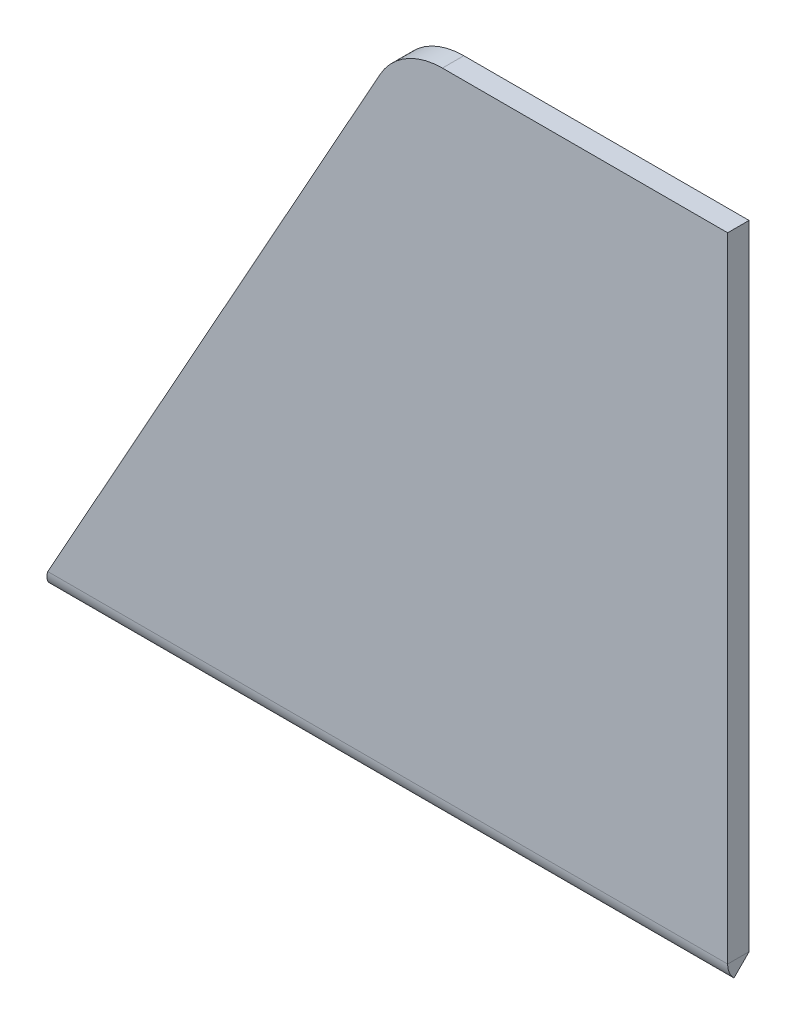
ISO-10303-21;
HEADER;
FILE_DESCRIPTION(('STEP AP214'),'2;1');
FILE_NAME('part.step','',(''),(''),'','','');
FILE_SCHEMA(('AUTOMOTIVE_DESIGN { 1 0 10303 214 1 1 1 1 }'));
ENDSEC;
DATA;
#1=APPLICATION_CONTEXT('core data for automotive mechanical design processes');
#2=APPLICATION_PROTOCOL_DEFINITION('international standard','automotive_design',2000,#1);
#3=PRODUCT_CONTEXT('',#1,'mechanical');
#4=PRODUCT('Part','Part','',(#3));
#5=PRODUCT_RELATED_PRODUCT_CATEGORY('part','',(#4));
#6=PRODUCT_DEFINITION_FORMATION('','',#4);
#7=PRODUCT_DEFINITION_CONTEXT('part definition',#1,'design');
#8=PRODUCT_DEFINITION('design','',#6,#7);
#9=PRODUCT_DEFINITION_SHAPE('','',#8);
#10=(LENGTH_UNIT() NAMED_UNIT(*) SI_UNIT(.MILLI.,.METRE.));
#11=(NAMED_UNIT(*) PLANE_ANGLE_UNIT() SI_UNIT($,.RADIAN.));
#12=(NAMED_UNIT(*) SI_UNIT($,.STERADIAN.) SOLID_ANGLE_UNIT());
#13=UNCERTAINTY_MEASURE_WITH_UNIT(LENGTH_MEASURE(1.E-05),#10,'distance_accuracy_value','');
#14=(GEOMETRIC_REPRESENTATION_CONTEXT(3) GLOBAL_UNCERTAINTY_ASSIGNED_CONTEXT((#13)) GLOBAL_UNIT_ASSIGNED_CONTEXT((#10,
#11,#12)) REPRESENTATION_CONTEXT('',''));
#15=CARTESIAN_POINT('',(0.,0.,0.));
#16=DIRECTION('',(0.,0.,1.));
#17=DIRECTION('',(1.,0.,0.));
#18=AXIS2_PLACEMENT_3D('',#15,#16,#17);
#19=CARTESIAN_POINT('',(30.,-0.9130973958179,-9.41309739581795));
#20=DIRECTION('',(-1.,0.,0.));
#21=DIRECTION('',(0.,-1.,0.));
#22=AXIS2_PLACEMENT_3D('',#19,#20,#21);
#23=PLANE('',#22);
#24=DIRECTION('',(0.,0.,1.));
#25=VECTOR('',#24,1.);
#26=CARTESIAN_POINT('',(30.,0.5869026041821,-9.41309739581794));
#27=LINE('',#26,#25);
#28=CARTESIAN_POINT('',(30.,0.5869026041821,-9.41309739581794));
#29=VERTEX_POINT('',#28);
#30=CARTESIAN_POINT('',(30.,0.586902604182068,-0.0100000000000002));
#31=VERTEX_POINT('',#30);
#32=EDGE_CURVE('E68',#29,#31,#27,.T.);
#33=ORIENTED_EDGE('',*,*,#32,.T.);
#34=DIRECTION('',(0.,-1.,0.));
#35=VECTOR('',#34,1.);
#36=CARTESIAN_POINT('',(30.,-0.913097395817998,-0.0100000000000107));
#37=LINE('',#36,#35);
#38=CARTESIAN_POINT('',(30.,-0.913097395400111,-0.0100000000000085));
#39=VERTEX_POINT('',#38);
#40=EDGE_CURVE('E160',#31,#39,#37,.T.);
#41=ORIENTED_EDGE('',*,*,#40,.T.);
#42=DIRECTION('',(0.,0.,1.));
#43=VECTOR('',#42,1.);
#44=CARTESIAN_POINT('',(30.,-0.9130973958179,-9.41309739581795));
#45=LINE('',#44,#43);
#46=CARTESIAN_POINT('',(30.,-0.9130973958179,-9.41309739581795));
#47=VERTEX_POINT('',#46);
#48=EDGE_CURVE('E340',#47,#39,#45,.T.);
#49=ORIENTED_EDGE('',*,*,#48,.F.);
#50=DIRECTION('',(0.,1.,0.));
#51=VECTOR('',#50,1.);
#52=CARTESIAN_POINT('',(30.,-0.9130973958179,-9.41309739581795));
#53=LINE('',#52,#51);
#54=EDGE_CURVE('E341',#47,#29,#53,.T.);
#55=ORIENTED_EDGE('',*,*,#54,.T.);
#56=EDGE_LOOP('',(#33,#41,#49,#55));
#57=FACE_BOUND('',#56,.T.);
#58=ADVANCED_FACE('F44',(#57),#23,.F.);
#59=CARTESIAN_POINT('',(0.,-0.913097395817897,-9.41309739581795));
#60=DIRECTION('',(1.,0.,0.));
#61=DIRECTION('',(0.,1.,0.));
#62=AXIS2_PLACEMENT_3D('',#59,#60,#61);
#63=PLANE('',#62);
#64=DIRECTION('',(0.,0.,-1.));
#65=VECTOR('',#64,1.);
#66=CARTESIAN_POINT('',(0.,-0.913097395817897,-9.41309739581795));
#67=LINE('',#66,#65);
#68=CARTESIAN_POINT('',(0.,-0.913097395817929,-0.0100000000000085));
#69=VERTEX_POINT('',#68);
#70=CARTESIAN_POINT('',(0.,-0.913097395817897,-9.41309739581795));
#71=VERTEX_POINT('',#70);
#72=EDGE_CURVE('E48',#69,#71,#67,.T.);
#73=ORIENTED_EDGE('',*,*,#72,.F.);
#74=DIRECTION('',(0.,1.,0.));
#75=VECTOR('',#74,1.);
#76=CARTESIAN_POINT('',(0.,-0.913097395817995,-0.0100000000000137));
#77=LINE('',#76,#75);
#78=CARTESIAN_POINT('',(0.,0.58690260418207,-0.0100000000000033));
#79=VERTEX_POINT('',#78);
#80=EDGE_CURVE('E12',#69,#79,#77,.T.);
#81=ORIENTED_EDGE('',*,*,#80,.T.);
#82=DIRECTION('',(0.,0.,-1.));
#83=VECTOR('',#82,1.);
#84=CARTESIAN_POINT('',(0.,0.586902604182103,-9.41309739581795));
#85=LINE('',#84,#83);
#86=CARTESIAN_POINT('',(0.,0.586902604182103,-9.41309739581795));
#87=VERTEX_POINT('',#86);
#88=EDGE_CURVE('E61',#79,#87,#85,.T.);
#89=ORIENTED_EDGE('',*,*,#88,.T.);
#90=DIRECTION('',(0.,1.,0.));
#91=VECTOR('',#90,1.);
#92=CARTESIAN_POINT('',(0.,-0.913097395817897,-9.41309739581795));
#93=LINE('',#92,#91);
#94=EDGE_CURVE('E343',#71,#87,#93,.T.);
#95=ORIENTED_EDGE('',*,*,#94,.F.);
#96=EDGE_LOOP('',(#73,#81,#89,#95));
#97=FACE_BOUND('',#96,.T.);
#98=ADVANCED_FACE('F46',(#97),#63,.F.);
#99=CARTESIAN_POINT('',(28.0000000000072,0.586902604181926,40.5869026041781));
#100=DIRECTION('',(0.,-1.,0.));
#101=DIRECTION('',(1.,0.,0.));
#102=AXIS2_PLACEMENT_3D('',#99,#100,#101);
#103=PLANE('',#102);
#104=CARTESIAN_POINT('',(22.,0.586902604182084,-4.41309739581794));
#105=DIRECTION('',(0.,-1.,0.));
#106=DIRECTION('',(1.,0.,0.));
#107=AXIS2_PLACEMENT_3D('',#104,#105,#106);
#108=CIRCLE('',#107,1.75);
#109=CARTESIAN_POINT('',(23.75,0.586902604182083,-4.41309739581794));
#110=VERTEX_POINT('',#109);
#111=EDGE_CURVE('E268',#110,#110,#108,.T.);
#112=ORIENTED_EDGE('',*,*,#111,.T.);
#113=EDGE_LOOP('',(#112));
#114=FACE_BOUND('',#113,.T.);
#115=CARTESIAN_POINT('',(8.,0.586902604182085,-4.41309739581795));
#116=DIRECTION('',(0.,-1.,0.));
#117=DIRECTION('',(1.,0.,0.));
#118=AXIS2_PLACEMENT_3D('',#115,#116,#117);
#119=CIRCLE('',#118,1.75);
#120=CARTESIAN_POINT('',(9.75,0.586902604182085,-4.41309739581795));
#121=VERTEX_POINT('',#120);
#122=EDGE_CURVE('E325',#121,#121,#119,.T.);
#123=ORIENTED_EDGE('',*,*,#122,.T.);
#124=EDGE_LOOP('',(#123));
#125=FACE_BOUND('',#124,.T.);
#126=ORIENTED_EDGE('',*,*,#88,.F.);
#127=DIRECTION('',(1.,0.,0.));
#128=VECTOR('',#127,1.);
#129=CARTESIAN_POINT('',(28.0000000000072,0.586902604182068,-0.00999999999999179));
#130=LINE('',#129,#128);
#131=EDGE_CURVE('E53',#79,#31,#130,.T.);
#132=ORIENTED_EDGE('',*,*,#131,.T.);
#133=ORIENTED_EDGE('',*,*,#32,.F.);
#134=DIRECTION('',(1.,0.,0.));
#135=VECTOR('',#134,1.);
#136=CARTESIAN_POINT('',(0.,0.586902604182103,-9.41309739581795));
#137=LINE('',#136,#135);
#138=EDGE_CURVE('E336',#87,#29,#137,.T.);
#139=ORIENTED_EDGE('',*,*,#138,.F.);
#140=EDGE_LOOP('',(#126,#132,#133,#139));
#141=FACE_BOUND('',#140,.T.);
#142=ADVANCED_FACE('F311',(#114,#125,#141),#103,.F.);
#143=CARTESIAN_POINT('',(28.0000000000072,-0.913097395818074,40.586902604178));
#144=DIRECTION('',(0.,-1.,0.));
#145=DIRECTION('',(1.,0.,0.));
#146=AXIS2_PLACEMENT_3D('',#143,#144,#145);
#147=PLANE('',#146);
#148=DIRECTION('',(1.,0.,0.));
#149=VECTOR('',#148,1.);
#150=CARTESIAN_POINT('',(28.0000000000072,-0.913097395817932,-0.0100000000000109));
#151=LINE('',#150,#149);
#152=EDGE_CURVE('E346',#69,#39,#151,.T.);
#153=ORIENTED_EDGE('',*,*,#152,.F.);
#154=ORIENTED_EDGE('',*,*,#72,.T.);
#155=DIRECTION('',(1.,0.,0.));
#156=VECTOR('',#155,1.);
#157=CARTESIAN_POINT('',(0.,-0.913097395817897,-9.41309739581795));
#158=LINE('',#157,#156);
#159=EDGE_CURVE('E338',#71,#47,#158,.T.);
#160=ORIENTED_EDGE('',*,*,#159,.T.);
#161=ORIENTED_EDGE('',*,*,#48,.T.);
#162=EDGE_LOOP('',(#153,#154,#160,#161));
#163=FACE_BOUND('',#162,.T.);
#164=CARTESIAN_POINT('',(8.,-0.913097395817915,-4.41309739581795));
#165=DIRECTION('',(0.,-1.,0.));
#166=DIRECTION('',(1.,0.,0.));
#167=AXIS2_PLACEMENT_3D('',#164,#165,#166);
#168=CIRCLE('',#167,1.75);
#169=CARTESIAN_POINT('',(9.75,-0.913097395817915,-4.41309739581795));
#170=VERTEX_POINT('',#169);
#171=EDGE_CURVE('E327',#170,#170,#168,.T.);
#172=ORIENTED_EDGE('',*,*,#171,.F.);
#173=EDGE_LOOP('',(#172));
#174=FACE_BOUND('',#173,.T.);
#175=CARTESIAN_POINT('',(22.,-0.913097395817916,-4.41309739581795));
#176=DIRECTION('',(0.,-1.,0.));
#177=DIRECTION('',(1.,0.,0.));
#178=AXIS2_PLACEMENT_3D('',#175,#176,#177);
#179=CIRCLE('',#178,1.75);
#180=CARTESIAN_POINT('',(23.75,-0.913097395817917,-4.41309739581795));
#181=VERTEX_POINT('',#180);
#182=EDGE_CURVE('E328',#181,#181,#179,.T.);
#183=ORIENTED_EDGE('',*,*,#182,.F.);
#184=EDGE_LOOP('',(#183));
#185=FACE_BOUND('',#184,.T.);
#186=ADVANCED_FACE('F307',(#163,#174,#185),#147,.T.);
#187=CARTESIAN_POINT('',(0.,-0.913097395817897,-9.41309739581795));
#188=DIRECTION('',(0.,0.,1.));
#189=DIRECTION('',(0.,-1.,0.));
#190=AXIS2_PLACEMENT_3D('',#187,#188,#189);
#191=PLANE('',#190);
#192=ORIENTED_EDGE('',*,*,#138,.T.);
#193=ORIENTED_EDGE('',*,*,#54,.F.);
#194=ORIENTED_EDGE('',*,*,#159,.F.);
#195=ORIENTED_EDGE('',*,*,#94,.T.);
#196=EDGE_LOOP('',(#192,#193,#194,#195));
#197=FACE_BOUND('',#196,.T.);
#198=ADVANCED_FACE('F303',(#197),#191,.F.);
#199=CARTESIAN_POINT('',(8.,-0.913097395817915,-4.41309739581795));
#200=DIRECTION('',(0.,1.,0.));
#201=DIRECTION('',(-1.,0.,0.));
#202=AXIS2_PLACEMENT_3D('',#199,#200,#201);
#203=CYLINDRICAL_SURFACE('',#202,1.75);
#204=ORIENTED_EDGE('',*,*,#171,.T.);
#205=EDGE_LOOP('',(#204));
#206=FACE_BOUND('',#205,.T.);
#207=ORIENTED_EDGE('',*,*,#122,.F.);
#208=EDGE_LOOP('',(#207));
#209=FACE_BOUND('',#208,.T.);
#210=ADVANCED_FACE('F299',(#206,#209),#203,.F.);
#211=CARTESIAN_POINT('',(22.,-0.913097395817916,-4.41309739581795));
#212=DIRECTION('',(0.,1.,0.));
#213=DIRECTION('',(-1.,0.,0.));
#214=AXIS2_PLACEMENT_3D('',#211,#212,#213);
#215=CYLINDRICAL_SURFACE('',#214,1.75);
#216=ORIENTED_EDGE('',*,*,#182,.T.);
#217=EDGE_LOOP('',(#216));
#218=FACE_BOUND('',#217,.T.);
#219=ORIENTED_EDGE('',*,*,#111,.F.);
#220=EDGE_LOOP('',(#219));
#221=FACE_BOUND('',#220,.T.);
#222=ADVANCED_FACE('F295',(#218,#221),#215,.F.);
#223=CARTESIAN_POINT('',(28.0000000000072,39.999999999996,1.5));
#224=DIRECTION('',(0.,0.,-1.));
#225=DIRECTION('',(-1.,0.,0.));
#226=AXIS2_PLACEMENT_3D('',#223,#224,#225);
#227=CYLINDRICAL_SURFACE('',#226,5.);
#228=CARTESIAN_POINT('',(28.0000000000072,39.999999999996,0.));
#229=DIRECTION('',(0.,0.,1.));
#230=DIRECTION('',(1.,0.,0.));
#231=AXIS2_PLACEMENT_3D('',#228,#229,#230);
#232=CIRCLE('',#231,5.);
#233=CARTESIAN_POINT('',(28.0000000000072,44.999999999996,0.));
#234=VERTEX_POINT('',#233);
#235=CARTESIAN_POINT('',(23.6317501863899,42.4327748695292,0.));
#236=VERTEX_POINT('',#235);
#237=EDGE_CURVE('E261',#234,#236,#232,.T.);
#238=ORIENTED_EDGE('',*,*,#237,.T.);
#239=DIRECTION('',(0.,0.,-1.));
#240=VECTOR('',#239,1.);
#241=CARTESIAN_POINT('',(23.6317501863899,42.4327748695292,1.5));
#242=LINE('',#241,#240);
#243=CARTESIAN_POINT('',(23.6317501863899,42.4327748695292,1.5));
#244=VERTEX_POINT('',#243);
#245=EDGE_CURVE('E239',#244,#236,#242,.T.);
#246=ORIENTED_EDGE('',*,*,#245,.F.);
#247=CARTESIAN_POINT('',(28.0000000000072,39.999999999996,1.5));
#248=DIRECTION('',(0.,0.,1.));
#249=DIRECTION('',(1.,0.,0.));
#250=AXIS2_PLACEMENT_3D('',#247,#248,#249);
#251=CIRCLE('',#250,5.);
#252=CARTESIAN_POINT('',(28.0000000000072,44.999999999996,1.5));
#253=VERTEX_POINT('',#252);
#254=EDGE_CURVE('E245',#253,#244,#251,.T.);
#255=ORIENTED_EDGE('',*,*,#254,.F.);
#256=DIRECTION('',(0.,0.,-1.));
#257=VECTOR('',#256,1.);
#258=CARTESIAN_POINT('',(28.0000000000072,44.999999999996,1.5));
#259=LINE('',#258,#257);
#260=EDGE_CURVE('E258',#253,#234,#259,.T.);
#261=ORIENTED_EDGE('',*,*,#260,.T.);
#262=EDGE_LOOP('',(#238,#246,#255,#261));
#263=FACE_BOUND('',#262,.T.);
#264=ADVANCED_FACE('F298',(#263),#227,.T.);
#265=CARTESIAN_POINT('',(48.,44.999999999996,1.5));
#266=DIRECTION('',(0.,-1.,0.));
#267=DIRECTION('',(0.,0.,-1.));
#268=AXIS2_PLACEMENT_3D('',#265,#266,#267);
#269=PLANE('',#268);
#270=DIRECTION('',(-1.,0.,0.));
#271=VECTOR('',#270,1.);
#272=CARTESIAN_POINT('',(48.,44.999999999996,0.));
#273=LINE('',#272,#271);
#274=CARTESIAN_POINT('',(48.,44.999999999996,0.));
#275=VERTEX_POINT('',#274);
#276=EDGE_CURVE('E256',#275,#234,#273,.T.);
#277=ORIENTED_EDGE('',*,*,#276,.T.);
#278=ORIENTED_EDGE('',*,*,#260,.F.);
#279=DIRECTION('',(-1.,0.,0.));
#280=VECTOR('',#279,1.);
#281=CARTESIAN_POINT('',(48.,44.999999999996,1.5));
#282=LINE('',#281,#280);
#283=CARTESIAN_POINT('',(48.,44.999999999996,1.5));
#284=VERTEX_POINT('',#283);
#285=EDGE_CURVE('E247',#284,#253,#282,.T.);
#286=ORIENTED_EDGE('',*,*,#285,.F.);
#287=DIRECTION('',(0.,0.,-1.));
#288=VECTOR('',#287,1.);
#289=CARTESIAN_POINT('',(48.,44.999999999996,1.5));
#290=LINE('',#289,#288);
#291=EDGE_CURVE('E252',#284,#275,#290,.T.);
#292=ORIENTED_EDGE('',*,*,#291,.T.);
#293=EDGE_LOOP('',(#277,#278,#286,#292));
#294=FACE_BOUND('',#293,.T.);
#295=ADVANCED_FACE('F515',(#294),#269,.F.);
#296=CARTESIAN_POINT('',(28.0000000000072,39.999999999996,1.5));
#297=DIRECTION('',(0.,0.,1.));
#298=DIRECTION('',(1.,0.,0.));
#299=AXIS2_PLACEMENT_3D('',#296,#297,#298);
#300=PLANE('',#299);
#301=DIRECTION('',(-0.486554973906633,-0.873649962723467,0.));
#302=VECTOR('',#301,1.);
#303=CARTESIAN_POINT('',(0.,0.,1.5));
#304=LINE('',#303,#302);
#305=CARTESIAN_POINT('',(0.332428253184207,0.596902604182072,1.5));
#306=VERTEX_POINT('',#305);
#307=EDGE_CURVE('E255',#244,#306,#304,.T.);
#308=ORIENTED_EDGE('',*,*,#307,.T.);
#309=DIRECTION('',(1.,0.,0.));
#310=VECTOR('',#309,1.);
#311=CARTESIAN_POINT('',(28.0000000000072,0.596902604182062,1.5));
#312=LINE('',#311,#310);
#313=CARTESIAN_POINT('',(48.,0.596902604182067,1.49999999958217));
#314=VERTEX_POINT('',#313);
#315=EDGE_CURVE('E251',#306,#314,#312,.T.);
#316=ORIENTED_EDGE('',*,*,#315,.T.);
#317=DIRECTION('',(0.,1.,0.));
#318=VECTOR('',#317,1.);
#319=CARTESIAN_POINT('',(48.,0.,1.5));
#320=LINE('',#319,#318);
#321=EDGE_CURVE('E249',#314,#284,#320,.T.);
#322=ORIENTED_EDGE('',*,*,#321,.T.);
#323=ORIENTED_EDGE('',*,*,#285,.T.);
#324=ORIENTED_EDGE('',*,*,#254,.T.);
#325=EDGE_LOOP('',(#308,#316,#322,#323,#324));
#326=FACE_BOUND('',#325,.T.);
#327=ADVANCED_FACE('F505',(#326),#300,.T.);
#328=CARTESIAN_POINT('',(48.,0.,1.5));
#329=DIRECTION('',(-1.,0.,0.));
#330=DIRECTION('',(0.,0.,1.));
#331=AXIS2_PLACEMENT_3D('',#328,#329,#330);
#332=PLANE('',#331);
#333=DIRECTION('',(0.,0.,1.));
#334=VECTOR('',#333,1.);
#335=CARTESIAN_POINT('',(48.,0.596902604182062,1.5));
#336=LINE('',#335,#334);
#337=CARTESIAN_POINT('',(48.,0.596902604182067,0.));
#338=VERTEX_POINT('',#337);
#339=EDGE_CURVE('E263',#338,#314,#336,.T.);
#340=ORIENTED_EDGE('',*,*,#339,.F.);
#341=DIRECTION('',(0.,1.,0.));
#342=VECTOR('',#341,1.);
#343=CARTESIAN_POINT('',(48.,0.,0.));
#344=LINE('',#343,#342);
#345=EDGE_CURVE('E243',#338,#275,#344,.T.);
#346=ORIENTED_EDGE('',*,*,#345,.T.);
#347=ORIENTED_EDGE('',*,*,#291,.F.);
#348=ORIENTED_EDGE('',*,*,#321,.F.);
#349=EDGE_LOOP('',(#340,#346,#347,#348));
#350=FACE_BOUND('',#349,.T.);
#351=ADVANCED_FACE('F472',(#350),#332,.F.);
#352=CARTESIAN_POINT('',(28.0000000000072,39.999999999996,0.));
#353=DIRECTION('',(0.,0.,1.));
#354=DIRECTION('',(1.,0.,0.));
#355=AXIS2_PLACEMENT_3D('',#352,#353,#354);
#356=PLANE('',#355);
#357=DIRECTION('',(1.,0.,0.));
#358=VECTOR('',#357,1.);
#359=CARTESIAN_POINT('',(28.0000000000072,0.596902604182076,0.));
#360=LINE('',#359,#358);
#361=CARTESIAN_POINT('',(0.332428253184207,0.596902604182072,0.));
#362=VERTEX_POINT('',#361);
#363=EDGE_CURVE('E266',#362,#338,#360,.T.);
#364=ORIENTED_EDGE('',*,*,#363,.F.);
#365=DIRECTION('',(-0.486554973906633,-0.873649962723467,0.));
#366=VECTOR('',#365,1.);
#367=CARTESIAN_POINT('',(0.,0.,0.));
#368=LINE('',#367,#366);
#369=EDGE_CURVE('E242',#236,#362,#368,.T.);
#370=ORIENTED_EDGE('',*,*,#369,.F.);
#371=ORIENTED_EDGE('',*,*,#237,.F.);
#372=ORIENTED_EDGE('',*,*,#276,.F.);
#373=ORIENTED_EDGE('',*,*,#345,.F.);
#374=EDGE_LOOP('',(#364,#370,#371,#372,#373));
#375=FACE_BOUND('',#374,.T.);
#376=ADVANCED_FACE('F293',(#375),#356,.F.);
#377=CARTESIAN_POINT('',(0.,0.,1.5));
#378=DIRECTION('',(0.873649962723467,-0.486554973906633,0.));
#379=DIRECTION('',(0.486554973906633,0.873649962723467,0.));
#380=AXIS2_PLACEMENT_3D('',#377,#378,#379);
#381=PLANE('',#380);
#382=CARTESIAN_POINT('',(0.332428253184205,0.596902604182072,1.49999999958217));
#383=CARTESIAN_POINT('',(0.332428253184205,0.596902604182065,-4.17827664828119E-10));
#384=B_SPLINE_CURVE_WITH_KNOTS('',1,(#382,#383),.UNSPECIFIED.,.F.,.F.,(2,2),(0.,1.),.UNSPECIFIED.);
#385=EDGE_CURVE('E228',#306,#362,#384,.T.);
#386=ORIENTED_EDGE('',*,*,#385,.F.);
#387=ORIENTED_EDGE('',*,*,#307,.F.);
#388=ORIENTED_EDGE('',*,*,#245,.T.);
#389=ORIENTED_EDGE('',*,*,#369,.T.);
#390=EDGE_LOOP('',(#386,#387,#388,#389));
#391=FACE_BOUND('',#390,.T.);
#392=ADVANCED_FACE('F283',(#391),#381,.F.);
#393=CARTESIAN_POINT('',(0.332428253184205,0.596902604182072,1.49999999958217));
#394=CARTESIAN_POINT('',(0.277014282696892,0.399211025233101,1.49999999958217));
#395=CARTESIAN_POINT('',(0.221618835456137,0.201663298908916,1.4606987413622));
#396=CARTESIAN_POINT('',(0.110809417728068,-0.163562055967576,1.30941744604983));
#397=CARTESIAN_POINT('',(0.0554139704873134,-0.331039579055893,1.19752029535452));
#398=CARTESIAN_POINT('',(0.,-0.470828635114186,1.05773123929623));
#399=CARTESIAN_POINT('',(0.332428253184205,0.596902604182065,-4.17827664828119E-10));
#400=CARTESIAN_POINT('',(0.277023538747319,0.595593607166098,-4.1782766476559E-10));
#401=CARTESIAN_POINT('',(0.221618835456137,0.594285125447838,-0.000260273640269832));
#402=CARTESIAN_POINT('',(0.110809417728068,0.591866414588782,-0.00126213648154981));
#403=CARTESIAN_POINT('',(0.0554047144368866,0.590757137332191,-0.00200333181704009));
#404=CARTESIAN_POINT('',(0.,0.589831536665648,-0.00292893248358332));
#405=B_SPLINE_SURFACE_WITH_KNOTS('',1,3,((#393,#394,#395,#396,#397,#398),(#399,#400,#401,#402,
#403,#404)),.UNSPECIFIED.,.F.,.F.,.F.,(2,2),(4,2,4),(0.,1.),(0.,0.5,1.),.UNSPECIFIED.);
#406=CARTESIAN_POINT('',(0.332428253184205,0.596902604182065,-4.17827664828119E-10));
#407=CARTESIAN_POINT('',(0.277023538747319,0.595593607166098,-4.1782766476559E-10));
#408=CARTESIAN_POINT('',(0.221618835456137,0.594285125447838,-0.000260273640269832));
#409=CARTESIAN_POINT('',(0.110809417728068,0.591866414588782,-0.00126213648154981));
#410=CARTESIAN_POINT('',(0.0554047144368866,0.590757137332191,-0.00200333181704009));
#411=CARTESIAN_POINT('',(0.,0.589831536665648,-0.00292893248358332));
#412=B_SPLINE_CURVE_WITH_KNOTS('',3,(#406,#407,#408,#409,#410,#411),.UNSPECIFIED.,.F.,.F.,(4,2,
4),(0.,0.5,1.),.UNSPECIFIED.);
#413=CARTESIAN_POINT('',(0.,0.589831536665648,-0.00292893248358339));
#414=VERTEX_POINT('',#413);
#415=EDGE_CURVE('E164',#362,#414,#412,.T.);
#416=CARTESIAN_POINT('',(0.,0.589831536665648,-0.00292893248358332));
#417=CARTESIAN_POINT('',(0.,-0.470828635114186,1.05773123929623));
#418=B_SPLINE_CURVE_WITH_KNOTS('',1,(#416,#417),.UNSPECIFIED.,.F.,.F.,(2,2),(0.,1.),.UNSPECIFIED.);
#419=CARTESIAN_POINT('',(0.,-0.470828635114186,1.05773123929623));
#420=VERTEX_POINT('',#419);
#421=EDGE_CURVE('E146',#414,#420,#418,.T.);
#422=CARTESIAN_POINT('',(0.,-0.470828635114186,1.05773123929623));
#423=CARTESIAN_POINT('',(0.0554139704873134,-0.331039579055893,1.19752029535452));
#424=CARTESIAN_POINT('',(0.110809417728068,-0.163562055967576,1.30941744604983));
#425=CARTESIAN_POINT('',(0.221618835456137,0.201663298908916,1.4606987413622));
#426=CARTESIAN_POINT('',(0.277014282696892,0.399211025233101,1.49999999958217));
#427=CARTESIAN_POINT('',(0.332428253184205,0.596902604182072,1.49999999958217));
#428=B_SPLINE_CURVE_WITH_KNOTS('',3,(#422,#423,#424,#425,#426,#427),.UNSPECIFIED.,.F.,.F.,(4,2,
4),(0.,0.5,1.),.UNSPECIFIED.);
#429=EDGE_CURVE('E168',#306,#420,#428,.F.);
#430=ORIENTED_EDGE('',*,*,#385,.T.);
#431=ORIENTED_EDGE('',*,*,#415,.T.);
#432=ORIENTED_EDGE('',*,*,#421,.T.);
#433=ORIENTED_EDGE('',*,*,#429,.F.);
#434=EDGE_LOOP('',(#430,#431,#432,#433));
#435=FACE_BOUND('',#434,.T.);
#436=ADVANCED_FACE('F205',(#435),#405,.T.);
#437=CARTESIAN_POINT('',(0.,0.596902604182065,-0.00999999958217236));
#438=DIRECTION('',(-1.,0.,0.));
#439=DIRECTION('',(0.,-1.,0.));
#440=AXIS2_PLACEMENT_3D('',#437,#438,#439);
#441=PLANE('',#440);
#442=ORIENTED_EDGE('',*,*,#421,.F.);
#443=CARTESIAN_POINT('',(0.,0.596902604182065,-0.01));
#444=DIRECTION('',(1.,0.,0.));
#445=DIRECTION('',(0.,1.,0.));
#446=AXIS2_PLACEMENT_3D('',#443,#444,#445);
#447=CIRCLE('',#446,0.00999999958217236);
#448=EDGE_CURVE('E161',#414,#79,#447,.T.);
#449=ORIENTED_EDGE('',*,*,#448,.T.);
#450=ORIENTED_EDGE('',*,*,#80,.F.);
#451=CARTESIAN_POINT('',(0.,0.596902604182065,-0.00999999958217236));
#452=DIRECTION('',(1.,0.,0.));
#453=DIRECTION('',(0.,1.,0.));
#454=AXIS2_PLACEMENT_3D('',#451,#452,#453);
#455=CIRCLE('',#454,1.50999999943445);
#456=EDGE_CURVE('E171',#420,#69,#455,.T.);
#457=ORIENTED_EDGE('',*,*,#456,.F.);
#458=EDGE_LOOP('',(#442,#449,#450,#457));
#459=FACE_BOUND('',#458,.T.);
#460=ADVANCED_FACE('F201',(#459),#441,.T.);
#461=CARTESIAN_POINT('',(30.,0.596902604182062,-0.00999999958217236));
#462=DIRECTION('',(1.,0.,0.));
#463=DIRECTION('',(0.,0.,-1.));
#464=AXIS2_PLACEMENT_3D('',#461,#462,#463);
#465=PLANE('',#464);
#466=ORIENTED_EDGE('',*,*,#40,.F.);
#467=CARTESIAN_POINT('',(30.,0.596902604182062,-0.01));
#468=DIRECTION('',(1.,0.,0.));
#469=DIRECTION('',(0.,1.,0.));
#470=AXIS2_PLACEMENT_3D('',#467,#468,#469);
#471=CIRCLE('',#470,0.00999999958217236);
#472=CARTESIAN_POINT('',(30.,0.589831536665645,-0.00292893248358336));
#473=VERTEX_POINT('',#472);
#474=EDGE_CURVE('E153',#31,#473,#471,.F.);
#475=ORIENTED_EDGE('',*,*,#474,.T.);
#476=DIRECTION('',(0.,-0.707106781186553,0.707106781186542));
#477=VECTOR('',#476,1.);
#478=CARTESIAN_POINT('',(30.,-0.470828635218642,1.05773123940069));
#479=LINE('',#478,#477);
#480=CARTESIAN_POINT('',(30.,-0.470828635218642,1.05773123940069));
#481=VERTEX_POINT('',#480);
#482=EDGE_CURVE('E135',#473,#481,#479,.T.);
#483=ORIENTED_EDGE('',*,*,#482,.T.);
#484=CARTESIAN_POINT('',(30.,0.596902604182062,-0.00999999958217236));
#485=DIRECTION('',(-1.,0.,0.));
#486=DIRECTION('',(0.,0.,1.));
#487=AXIS2_PLACEMENT_3D('',#484,#485,#486);
#488=CIRCLE('',#487,1.50999999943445);
#489=EDGE_CURVE('E169',#39,#481,#488,.T.);
#490=ORIENTED_EDGE('',*,*,#489,.F.);
#491=EDGE_LOOP('',(#466,#475,#483,#490));
#492=FACE_BOUND('',#491,.T.);
#493=ADVANCED_FACE('F159',(#492),#465,.T.);
#494=CARTESIAN_POINT('',(39.,-0.470828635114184,1.05773123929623));
#495=DIRECTION('',(0.,-0.707106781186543,-0.707106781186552));
#496=DIRECTION('',(1.,0.,0.));
#497=AXIS2_PLACEMENT_3D('',#494,#495,#496);
#498=PLANE('',#497);
#499=ORIENTED_EDGE('',*,*,#482,.F.);
#500=DIRECTION('',(1.,0.,0.));
#501=VECTOR('',#500,1.);
#502=CARTESIAN_POINT('',(-23.8720536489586,0.58983153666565,-0.00292893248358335));
#503=LINE('',#502,#501);
#504=CARTESIAN_POINT('',(48.,0.589831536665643,-0.00292893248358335));
#505=VERTEX_POINT('',#504);
#506=EDGE_CURVE('E138',#473,#505,#503,.T.);
#507=ORIENTED_EDGE('',*,*,#506,.T.);
#508=DIRECTION('',(0.,-0.707106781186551,0.707106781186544));
#509=VECTOR('',#508,1.);
#510=CARTESIAN_POINT('',(48.,-0.470828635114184,1.05773123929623));
#511=LINE('',#510,#509);
#512=CARTESIAN_POINT('',(48.,-0.470828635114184,1.05773123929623));
#513=VERTEX_POINT('',#512);
#514=EDGE_CURVE('E147',#505,#513,#511,.T.);
#515=ORIENTED_EDGE('',*,*,#514,.T.);
#516=DIRECTION('',(1.,0.,0.));
#517=VECTOR('',#516,1.);
#518=CARTESIAN_POINT('',(30.,-0.470828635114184,1.05773123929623));
#519=LINE('',#518,#517);
#520=EDGE_CURVE('E141',#481,#513,#519,.T.);
#521=ORIENTED_EDGE('',*,*,#520,.F.);
#522=EDGE_LOOP('',(#499,#507,#515,#521));
#523=FACE_BOUND('',#522,.T.);
#524=ADVANCED_FACE('F137',(#523),#498,.T.);
#525=CARTESIAN_POINT('',(48.,0.59690260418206,-0.00999999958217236));
#526=DIRECTION('',(1.,0.,0.));
#527=DIRECTION('',(0.,0.,-1.));
#528=AXIS2_PLACEMENT_3D('',#525,#526,#527);
#529=PLANE('',#528);
#530=CARTESIAN_POINT('',(48.,0.59690260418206,-0.01));
#531=DIRECTION('',(1.,0.,0.));
#532=DIRECTION('',(0.,1.,0.));
#533=AXIS2_PLACEMENT_3D('',#530,#531,#532);
#534=CIRCLE('',#533,0.00999999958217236);
#535=EDGE_CURVE('E156',#505,#338,#534,.F.);
#536=ORIENTED_EDGE('',*,*,#535,.T.);
#537=ORIENTED_EDGE('',*,*,#339,.T.);
#538=CARTESIAN_POINT('',(48.,0.59690260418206,-0.00999999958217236));
#539=DIRECTION('',(-1.,0.,0.));
#540=DIRECTION('',(0.,0.,1.));
#541=AXIS2_PLACEMENT_3D('',#538,#539,#540);
#542=CIRCLE('',#541,1.50999999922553);
#543=EDGE_CURVE('E173',#513,#314,#542,.T.);
#544=ORIENTED_EDGE('',*,*,#543,.F.);
#545=ORIENTED_EDGE('',*,*,#514,.F.);
#546=EDGE_LOOP('',(#536,#537,#544,#545));
#547=FACE_BOUND('',#546,.T.);
#548=ADVANCED_FACE('F194',(#547),#529,.T.);
#549=CARTESIAN_POINT('',(-23.8720536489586,0.596902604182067,-0.01));
#550=DIRECTION('',(1.,0.,0.));
#551=DIRECTION('',(0.,1.,0.));
#552=AXIS2_PLACEMENT_3D('',#549,#550,#551);
#553=CYLINDRICAL_SURFACE('',#552,1.50999999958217);
#554=ORIENTED_EDGE('',*,*,#520,.T.);
#555=ORIENTED_EDGE('',*,*,#543,.T.);
#556=ORIENTED_EDGE('',*,*,#315,.F.);
#557=ORIENTED_EDGE('',*,*,#429,.T.);
#558=ORIENTED_EDGE('',*,*,#456,.T.);
#559=ORIENTED_EDGE('',*,*,#152,.T.);
#560=ORIENTED_EDGE('',*,*,#489,.T.);
#561=EDGE_LOOP('',(#554,#555,#556,#557,#558,#559,#560));
#562=FACE_BOUND('',#561,.T.);
#563=ADVANCED_FACE('F184',(#562),#553,.T.);
#564=CARTESIAN_POINT('',(-23.8720536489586,0.596902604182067,-0.01));
#565=DIRECTION('',(1.,0.,0.));
#566=DIRECTION('',(0.,1.,0.));
#567=AXIS2_PLACEMENT_3D('',#564,#565,#566);
#568=CYLINDRICAL_SURFACE('',#567,0.00999999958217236);
#569=ORIENTED_EDGE('',*,*,#506,.F.);
#570=ORIENTED_EDGE('',*,*,#474,.F.);
#571=ORIENTED_EDGE('',*,*,#131,.F.);
#572=ORIENTED_EDGE('',*,*,#448,.F.);
#573=ORIENTED_EDGE('',*,*,#415,.F.);
#574=ORIENTED_EDGE('',*,*,#363,.T.);
#575=ORIENTED_EDGE('',*,*,#535,.F.);
#576=EDGE_LOOP('',(#569,#570,#571,#572,#573,#574,#575));
#577=FACE_BOUND('',#576,.T.);
#578=ADVANCED_FACE('F151',(#577),#568,.F.);
#579=CLOSED_SHELL('',(#58,#98,#142,#186,#198,#210,#222,#264,#295,#327,#351,#376,#392,#436,#460,
#493,#524,#548,#563,#578));
#580=MANIFOLD_SOLID_BREP('B2',#579);
#581=ADVANCED_BREP_SHAPE_REPRESENTATION('',(#18,#580),#14);
#582=SHAPE_DEFINITION_REPRESENTATION(#9,#581);
ENDSEC;
END-ISO-10303-21;
